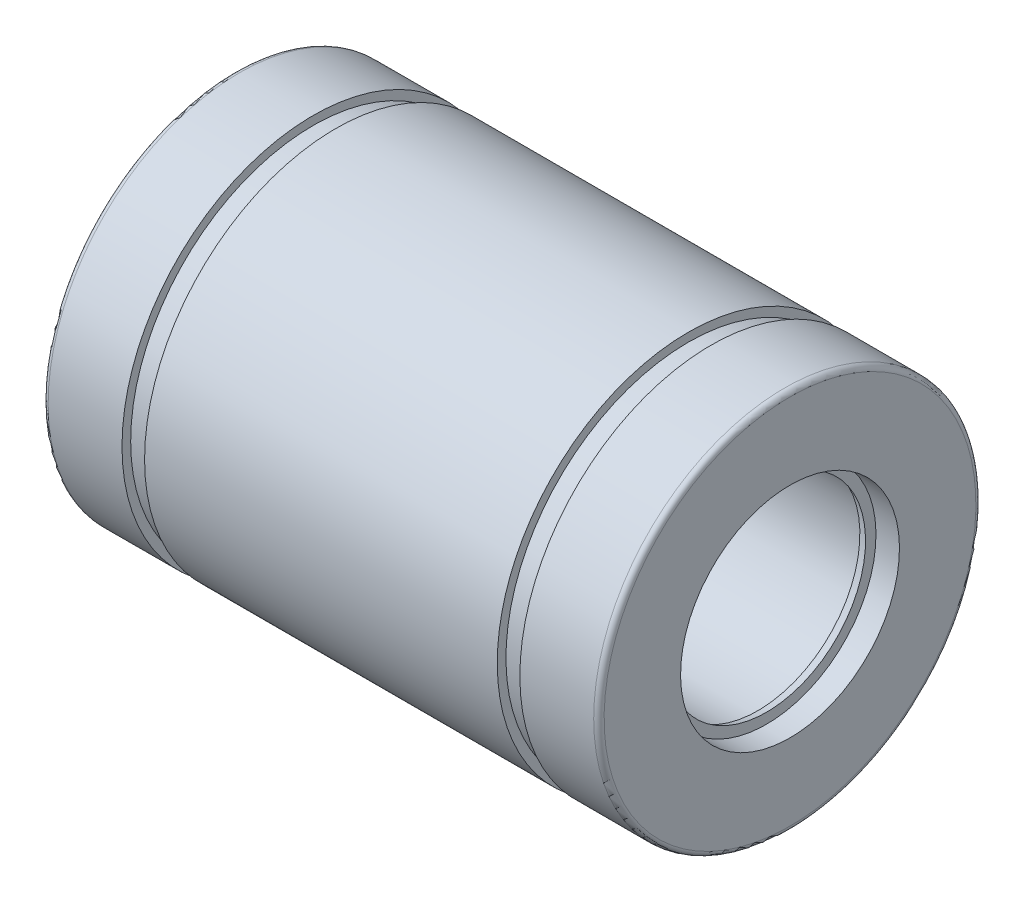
ISO-10303-21;
HEADER;
FILE_DESCRIPTION(('STEP AP214'),'2;1');
FILE_NAME('part.step','',(''),(''),'','','');
FILE_SCHEMA(('AUTOMOTIVE_DESIGN { 1 0 10303 214 1 1 1 1 }'));
ENDSEC;
DATA;
#1=APPLICATION_CONTEXT('core data for automotive mechanical design processes');
#2=APPLICATION_PROTOCOL_DEFINITION('international standard','automotive_design',2000,#1);
#3=PRODUCT_CONTEXT('',#1,'mechanical');
#4=PRODUCT('Part','Part','',(#3));
#5=PRODUCT_RELATED_PRODUCT_CATEGORY('part','',(#4));
#6=PRODUCT_DEFINITION_FORMATION('','',#4);
#7=PRODUCT_DEFINITION_CONTEXT('part definition',#1,'design');
#8=PRODUCT_DEFINITION('design','',#6,#7);
#9=PRODUCT_DEFINITION_SHAPE('','',#8);
#10=(LENGTH_UNIT() NAMED_UNIT(*) SI_UNIT(.MILLI.,.METRE.));
#11=(NAMED_UNIT(*) PLANE_ANGLE_UNIT() SI_UNIT($,.RADIAN.));
#12=(NAMED_UNIT(*) SI_UNIT($,.STERADIAN.) SOLID_ANGLE_UNIT());
#13=UNCERTAINTY_MEASURE_WITH_UNIT(LENGTH_MEASURE(1.E-05),#10,'distance_accuracy_value','');
#14=(GEOMETRIC_REPRESENTATION_CONTEXT(3) GLOBAL_UNCERTAINTY_ASSIGNED_CONTEXT((#13)) GLOBAL_UNIT_ASSIGNED_CONTEXT((#10,
#11,#12)) REPRESENTATION_CONTEXT('',''));
#15=CARTESIAN_POINT('',(0.,0.,0.));
#16=DIRECTION('',(0.,0.,1.));
#17=DIRECTION('',(1.,0.,0.));
#18=AXIS2_PLACEMENT_3D('',#15,#16,#17);
#19=CARTESIAN_POINT('',(0.,0.,-5.5));
#20=DIRECTION('',(-1.,0.,0.));
#21=DIRECTION('',(0.,0.,1.));
#22=AXIS2_PLACEMENT_3D('',#19,#20,#21);
#23=PLANE('',#22);
#24=CARTESIAN_POINT('',(0.,0.,0.));
#25=DIRECTION('',(1.,0.,0.));
#26=DIRECTION('',(0.,0.,-1.));
#27=AXIS2_PLACEMENT_3D('',#24,#25,#26);
#28=CIRCLE('',#27,6.3);
#29=CARTESIAN_POINT('',(0.,0.,6.3));
#30=VERTEX_POINT('',#29);
#31=EDGE_CURVE('E247',#30,#30,#28,.T.);
#32=ORIENTED_EDGE('',*,*,#31,.T.);
#33=EDGE_LOOP('',(#32));
#34=FACE_BOUND('',#33,.T.);
#35=CARTESIAN_POINT('',(0.,0.,0.));
#36=DIRECTION('',(-1.,0.,0.));
#37=DIRECTION('',(0.,0.,1.));
#38=AXIS2_PLACEMENT_3D('',#35,#36,#37);
#39=CIRCLE('',#38,10.7);
#40=CARTESIAN_POINT('',(0.,0.,10.7));
#41=VERTEX_POINT('',#40);
#42=CARTESIAN_POINT('',(0.,10.7,0.));
#43=VERTEX_POINT('',#42);
#44=EDGE_CURVE('E251',#41,#43,#39,.T.);
#45=ORIENTED_EDGE('',*,*,#44,.T.);
#46=CARTESIAN_POINT('',(0.,0.,0.));
#47=DIRECTION('',(-1.,0.,0.));
#48=DIRECTION('',(0.,0.,1.));
#49=AXIS2_PLACEMENT_3D('',#46,#47,#48);
#50=CIRCLE('',#49,10.7);
#51=EDGE_CURVE('E254',#43,#41,#50,.T.);
#52=ORIENTED_EDGE('',*,*,#51,.T.);
#53=EDGE_LOOP('',(#45,#52));
#54=FACE_BOUND('',#53,.T.);
#55=ADVANCED_FACE('F16',(#34,#54),#23,.T.);
#56=CARTESIAN_POINT('',(5.85,0.,-10.75));
#57=DIRECTION('',(1.,0.,0.));
#58=DIRECTION('',(0.,1.,0.));
#59=AXIS2_PLACEMENT_3D('',#56,#57,#58);
#60=PLANE('',#59);
#61=CARTESIAN_POINT('',(5.85,0.,0.));
#62=DIRECTION('',(1.,0.,0.));
#63=DIRECTION('',(0.,0.,-1.));
#64=AXIS2_PLACEMENT_3D('',#61,#62,#63);
#65=CIRCLE('',#64,10.5);
#66=CARTESIAN_POINT('',(5.85,0.,10.5));
#67=VERTEX_POINT('',#66);
#68=EDGE_CURVE('E332',#67,#67,#65,.T.);
#69=ORIENTED_EDGE('',*,*,#68,.T.);
#70=EDGE_LOOP('',(#69));
#71=FACE_BOUND('',#70,.T.);
#72=CARTESIAN_POINT('',(5.85,0.,0.));
#73=DIRECTION('',(1.,0.,0.));
#74=DIRECTION('',(0.,0.,-1.));
#75=AXIS2_PLACEMENT_3D('',#72,#73,#74);
#76=CIRCLE('',#75,11.);
#77=CARTESIAN_POINT('',(5.85,0.,11.));
#78=VERTEX_POINT('',#77);
#79=EDGE_CURVE('E306',#78,#78,#76,.T.);
#80=ORIENTED_EDGE('',*,*,#79,.F.);
#81=EDGE_LOOP('',(#80));
#82=FACE_BOUND('',#81,.T.);
#83=ADVANCED_FACE('F238',(#71,#82),#60,.F.);
#84=CARTESIAN_POINT('',(4.55,0.,-10.75));
#85=DIRECTION('',(-1.,0.,0.));
#86=DIRECTION('',(0.,0.,1.));
#87=AXIS2_PLACEMENT_3D('',#84,#85,#86);
#88=PLANE('',#87);
#89=CARTESIAN_POINT('',(4.55,0.,0.));
#90=DIRECTION('',(1.,0.,0.));
#91=DIRECTION('',(0.,0.,-1.));
#92=AXIS2_PLACEMENT_3D('',#89,#90,#91);
#93=CIRCLE('',#92,10.5);
#94=CARTESIAN_POINT('',(4.55,0.,10.5));
#95=VERTEX_POINT('',#94);
#96=EDGE_CURVE('E323',#95,#95,#93,.T.);
#97=ORIENTED_EDGE('',*,*,#96,.F.);
#98=EDGE_LOOP('',(#97));
#99=FACE_BOUND('',#98,.T.);
#100=CARTESIAN_POINT('',(4.55,0.,0.));
#101=DIRECTION('',(-1.,0.,0.));
#102=DIRECTION('',(0.,0.,-1.));
#103=AXIS2_PLACEMENT_3D('',#100,#101,#102);
#104=CIRCLE('',#103,11.);
#105=CARTESIAN_POINT('',(4.55,0.,11.));
#106=VERTEX_POINT('',#105);
#107=EDGE_CURVE('E268',#106,#106,#104,.T.);
#108=ORIENTED_EDGE('',*,*,#107,.F.);
#109=EDGE_LOOP('',(#108));
#110=FACE_BOUND('',#109,.T.);
#111=ADVANCED_FACE('F243',(#99,#110),#88,.F.);
#112=CARTESIAN_POINT('',(1.352,0.,-6.6));
#113=DIRECTION('',(-1.,0.,0.));
#114=DIRECTION('',(0.,0.,1.));
#115=AXIS2_PLACEMENT_3D('',#112,#113,#114);
#116=PLANE('',#115);
#117=CARTESIAN_POINT('',(1.352,0.,0.));
#118=DIRECTION('',(1.,0.,0.));
#119=DIRECTION('',(0.,0.,-1.));
#120=AXIS2_PLACEMENT_3D('',#117,#118,#119);
#121=CIRCLE('',#120,6.3);
#122=CARTESIAN_POINT('',(1.352,0.,6.3));
#123=VERTEX_POINT('',#122);
#124=EDGE_CURVE('E302',#123,#123,#121,.T.);
#125=ORIENTED_EDGE('',*,*,#124,.F.);
#126=EDGE_LOOP('',(#125));
#127=FACE_BOUND('',#126,.T.);
#128=CARTESIAN_POINT('',(1.352,0.,0.));
#129=DIRECTION('',(1.,0.,0.));
#130=DIRECTION('',(0.,0.,-1.));
#131=AXIS2_PLACEMENT_3D('',#128,#129,#130);
#132=CIRCLE('',#131,7.2);
#133=CARTESIAN_POINT('',(1.352,0.,7.2));
#134=VERTEX_POINT('',#133);
#135=EDGE_CURVE('E352',#134,#134,#132,.T.);
#136=ORIENTED_EDGE('',*,*,#135,.T.);
#137=EDGE_LOOP('',(#136));
#138=FACE_BOUND('',#137,.T.);
#139=ADVANCED_FACE('F462',(#127,#138),#116,.F.);
#140=CARTESIAN_POINT('',(1.859,0.,-6.6));
#141=DIRECTION('',(1.,0.,0.));
#142=DIRECTION('',(0.,0.,-1.));
#143=AXIS2_PLACEMENT_3D('',#140,#141,#142);
#144=PLANE('',#143);
#145=CARTESIAN_POINT('',(1.859,0.,0.));
#146=DIRECTION('',(-1.,0.,0.));
#147=DIRECTION('',(0.,0.,-1.));
#148=AXIS2_PLACEMENT_3D('',#145,#146,#147);
#149=CIRCLE('',#148,6.);
#150=CARTESIAN_POINT('',(1.859,0.,6.));
#151=VERTEX_POINT('',#150);
#152=EDGE_CURVE('E280',#151,#151,#149,.T.);
#153=ORIENTED_EDGE('',*,*,#152,.F.);
#154=EDGE_LOOP('',(#153));
#155=FACE_BOUND('',#154,.T.);
#156=CARTESIAN_POINT('',(1.859,0.,0.));
#157=DIRECTION('',(1.,0.,0.));
#158=DIRECTION('',(0.,0.,-1.));
#159=AXIS2_PLACEMENT_3D('',#156,#157,#158);
#160=CIRCLE('',#159,7.2);
#161=CARTESIAN_POINT('',(1.859,0.,7.2));
#162=VERTEX_POINT('',#161);
#163=EDGE_CURVE('E177',#162,#162,#160,.T.);
#164=ORIENTED_EDGE('',*,*,#163,.F.);
#165=EDGE_LOOP('',(#164));
#166=FACE_BOUND('',#165,.T.);
#167=ADVANCED_FACE('F456',(#155,#166),#144,.F.);
#168=CARTESIAN_POINT('',(32.,2.75,4.76313972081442));
#169=DIRECTION('',(1.,0.,0.));
#170=DIRECTION('',(0.,-1.,0.));
#171=AXIS2_PLACEMENT_3D('',#168,#169,#170);
#172=PLANE('',#171);
#173=CARTESIAN_POINT('',(32.,0.,0.));
#174=DIRECTION('',(-1.,0.,0.));
#175=DIRECTION('',(0.,0.5,0.866025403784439));
#176=AXIS2_PLACEMENT_3D('',#173,#174,#175);
#177=CIRCLE('',#176,6.3);
#178=CARTESIAN_POINT('',(32.,-3.15,-5.45596004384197));
#179=VERTEX_POINT('',#178);
#180=EDGE_CURVE('E162',#179,#179,#177,.T.);
#181=ORIENTED_EDGE('',*,*,#180,.T.);
#182=EDGE_LOOP('',(#181));
#183=FACE_BOUND('',#182,.T.);
#184=CARTESIAN_POINT('',(32.,0.,0.));
#185=DIRECTION('',(1.,0.,0.));
#186=DIRECTION('',(0.,0.,-1.));
#187=AXIS2_PLACEMENT_3D('',#184,#185,#186);
#188=CIRCLE('',#187,10.7);
#189=CARTESIAN_POINT('',(32.,-5.35,-9.26647182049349));
#190=VERTEX_POINT('',#189);
#191=CARTESIAN_POINT('',(32.,9.26647182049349,-5.35));
#192=VERTEX_POINT('',#191);
#193=EDGE_CURVE('E364',#190,#192,#188,.T.);
#194=ORIENTED_EDGE('',*,*,#193,.T.);
#195=CARTESIAN_POINT('',(32.,0.,0.));
#196=DIRECTION('',(1.,0.,0.));
#197=DIRECTION('',(0.,0.,-1.));
#198=AXIS2_PLACEMENT_3D('',#195,#196,#197);
#199=CIRCLE('',#198,10.7);
#200=EDGE_CURVE('E360',#192,#190,#199,.T.);
#201=ORIENTED_EDGE('',*,*,#200,.T.);
#202=EDGE_LOOP('',(#194,#201));
#203=FACE_BOUND('',#202,.T.);
#204=ADVANCED_FACE('F451',(#183,#203),#172,.T.);
#205=CARTESIAN_POINT('',(26.15,5.375,9.30977309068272));
#206=DIRECTION('',(-1.,0.,0.));
#207=DIRECTION('',(0.,0.,1.));
#208=AXIS2_PLACEMENT_3D('',#205,#206,#207);
#209=PLANE('',#208);
#210=CARTESIAN_POINT('',(26.15,0.,0.));
#211=DIRECTION('',(-1.,0.,0.));
#212=DIRECTION('',(0.,0.5,0.866025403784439));
#213=AXIS2_PLACEMENT_3D('',#210,#211,#212);
#214=CIRCLE('',#213,10.5);
#215=CARTESIAN_POINT('',(26.15,-5.25,-9.09326673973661));
#216=VERTEX_POINT('',#215);
#217=EDGE_CURVE('E156',#216,#216,#214,.T.);
#218=ORIENTED_EDGE('',*,*,#217,.T.);
#219=EDGE_LOOP('',(#218));
#220=FACE_BOUND('',#219,.T.);
#221=CARTESIAN_POINT('',(26.15,0.,0.));
#222=DIRECTION('',(-1.,0.,0.));
#223=DIRECTION('',(0.,0.5,0.866025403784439));
#224=AXIS2_PLACEMENT_3D('',#221,#222,#223);
#225=CIRCLE('',#224,11.);
#226=CARTESIAN_POINT('',(26.15,5.5,9.52627944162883));
#227=VERTEX_POINT('',#226);
#228=CARTESIAN_POINT('',(26.15,0.,11.));
#229=VERTEX_POINT('',#228);
#230=EDGE_CURVE('E317',#227,#229,#225,.T.);
#231=ORIENTED_EDGE('',*,*,#230,.F.);
#232=CARTESIAN_POINT('',(26.15,0.,0.));
#233=DIRECTION('',(-1.,0.,0.));
#234=DIRECTION('',(0.,0.5,0.866025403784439));
#235=AXIS2_PLACEMENT_3D('',#232,#233,#234);
#236=CIRCLE('',#235,11.);
#237=EDGE_CURVE('E311',#229,#227,#236,.T.);
#238=ORIENTED_EDGE('',*,*,#237,.F.);
#239=EDGE_LOOP('',(#231,#238));
#240=FACE_BOUND('',#239,.T.);
#241=ADVANCED_FACE('F232',(#220,#240),#209,.F.);
#242=CARTESIAN_POINT('',(27.45,5.375,9.30977309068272));
#243=DIRECTION('',(1.,0.,0.));
#244=DIRECTION('',(0.,-1.,0.));
#245=AXIS2_PLACEMENT_3D('',#242,#243,#244);
#246=PLANE('',#245);
#247=CARTESIAN_POINT('',(27.45,0.,0.));
#248=DIRECTION('',(-1.,0.,0.));
#249=DIRECTION('',(0.,0.5,0.866025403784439));
#250=AXIS2_PLACEMENT_3D('',#247,#248,#249);
#251=CIRCLE('',#250,10.5);
#252=CARTESIAN_POINT('',(27.45,-5.25,-9.09326673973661));
#253=VERTEX_POINT('',#252);
#254=EDGE_CURVE('E383',#253,#253,#251,.T.);
#255=ORIENTED_EDGE('',*,*,#254,.F.);
#256=EDGE_LOOP('',(#255));
#257=FACE_BOUND('',#256,.T.);
#258=CARTESIAN_POINT('',(27.45,0.,0.));
#259=DIRECTION('',(1.,0.,0.));
#260=DIRECTION('',(0.,0.5,0.866025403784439));
#261=AXIS2_PLACEMENT_3D('',#258,#259,#260);
#262=CIRCLE('',#261,11.);
#263=CARTESIAN_POINT('',(27.45,-5.5,-9.52627944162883));
#264=VERTEX_POINT('',#263);
#265=EDGE_CURVE('E372',#264,#264,#262,.T.);
#266=ORIENTED_EDGE('',*,*,#265,.F.);
#267=EDGE_LOOP('',(#266));
#268=FACE_BOUND('',#267,.T.);
#269=ADVANCED_FACE('F221',(#257,#268),#246,.F.);
#270=CARTESIAN_POINT('',(30.648,3.3,5.7157676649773));
#271=DIRECTION('',(1.,0.,0.));
#272=DIRECTION('',(0.,-1.,0.));
#273=AXIS2_PLACEMENT_3D('',#270,#271,#272);
#274=PLANE('',#273);
#275=CARTESIAN_POINT('',(30.648,0.,0.));
#276=DIRECTION('',(-1.,0.,0.));
#277=DIRECTION('',(0.,0.5,0.866025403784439));
#278=AXIS2_PLACEMENT_3D('',#275,#276,#277);
#279=CIRCLE('',#278,6.3);
#280=CARTESIAN_POINT('',(30.648,-3.15,-5.45596004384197));
#281=VERTEX_POINT('',#280);
#282=EDGE_CURVE('E163',#281,#281,#279,.T.);
#283=ORIENTED_EDGE('',*,*,#282,.F.);
#284=EDGE_LOOP('',(#283));
#285=FACE_BOUND('',#284,.T.);
#286=CARTESIAN_POINT('',(30.648,0.,0.));
#287=DIRECTION('',(-1.,0.,0.));
#288=DIRECTION('',(0.,0.5,0.866025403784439));
#289=AXIS2_PLACEMENT_3D('',#286,#287,#288);
#290=CIRCLE('',#289,7.2);
#291=CARTESIAN_POINT('',(30.648,-3.6,-6.23538290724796));
#292=VERTEX_POINT('',#291);
#293=EDGE_CURVE('E174',#292,#292,#290,.T.);
#294=ORIENTED_EDGE('',*,*,#293,.T.);
#295=EDGE_LOOP('',(#294));
#296=FACE_BOUND('',#295,.T.);
#297=ADVANCED_FACE('F218',(#285,#296),#274,.F.);
#298=CARTESIAN_POINT('',(30.141,3.3,5.7157676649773));
#299=DIRECTION('',(-1.,0.,0.));
#300=DIRECTION('',(0.,0.,1.));
#301=AXIS2_PLACEMENT_3D('',#298,#299,#300);
#302=PLANE('',#301);
#303=CARTESIAN_POINT('',(30.141,0.,0.));
#304=DIRECTION('',(1.,0.,0.));
#305=DIRECTION('',(0.,0.5,0.866025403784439));
#306=AXIS2_PLACEMENT_3D('',#303,#304,#305);
#307=CIRCLE('',#306,6.);
#308=CARTESIAN_POINT('',(30.141,3.,5.19615242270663));
#309=VERTEX_POINT('',#308);
#310=CARTESIAN_POINT('',(30.141,0.,6.));
#311=VERTEX_POINT('',#310);
#312=EDGE_CURVE('E281',#309,#311,#307,.T.);
#313=ORIENTED_EDGE('',*,*,#312,.F.);
#314=CARTESIAN_POINT('',(30.141,0.,0.));
#315=DIRECTION('',(1.,0.,0.));
#316=DIRECTION('',(0.,0.5,0.866025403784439));
#317=AXIS2_PLACEMENT_3D('',#314,#315,#316);
#318=CIRCLE('',#317,6.);
#319=EDGE_CURVE('E303',#311,#309,#318,.T.);
#320=ORIENTED_EDGE('',*,*,#319,.F.);
#321=EDGE_LOOP('',(#313,#320));
#322=FACE_BOUND('',#321,.T.);
#323=CARTESIAN_POINT('',(30.141,0.,0.));
#324=DIRECTION('',(-1.,0.,0.));
#325=DIRECTION('',(0.,0.5,0.866025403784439));
#326=AXIS2_PLACEMENT_3D('',#323,#324,#325);
#327=CIRCLE('',#326,7.2);
#328=CARTESIAN_POINT('',(30.141,-3.6,-6.23538290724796));
#329=VERTEX_POINT('',#328);
#330=EDGE_CURVE('E152',#329,#329,#327,.T.);
#331=ORIENTED_EDGE('',*,*,#330,.F.);
#332=EDGE_LOOP('',(#331));
#333=FACE_BOUND('',#332,.T.);
#334=ADVANCED_FACE('F220',(#322,#333),#302,.F.);
#335=CARTESIAN_POINT('',(1.858,0.,-3.6036));
#336=DIRECTION('',(1.,0.,0.));
#337=DIRECTION('',(0.,1.,0.));
#338=AXIS2_PLACEMENT_3D('',#335,#336,#337);
#339=PLANE('',#338);
#340=CARTESIAN_POINT('',(1.858,0.,0.));
#341=DIRECTION('',(-1.,0.,0.));
#342=DIRECTION('',(0.,0.,-1.));
#343=AXIS2_PLACEMENT_3D('',#340,#341,#342);
#344=CIRCLE('',#343,5.88);
#345=CARTESIAN_POINT('',(1.858,0.,5.88));
#346=VERTEX_POINT('',#345);
#347=EDGE_CURVE('E196',#346,#346,#344,.T.);
#348=ORIENTED_EDGE('',*,*,#347,.T.);
#349=EDGE_LOOP('',(#348));
#350=FACE_BOUND('',#349,.T.);
#351=CARTESIAN_POINT('',(1.858,0.,0.));
#352=DIRECTION('',(-1.,0.,0.));
#353=DIRECTION('',(0.,0.,-1.));
#354=AXIS2_PLACEMENT_3D('',#351,#352,#353);
#355=CIRCLE('',#354,7.2);
#356=CARTESIAN_POINT('',(1.858,0.,7.2));
#357=VERTEX_POINT('',#356);
#358=EDGE_CURVE('E185',#357,#357,#355,.T.);
#359=ORIENTED_EDGE('',*,*,#358,.F.);
#360=EDGE_LOOP('',(#359));
#361=FACE_BOUND('',#360,.T.);
#362=ADVANCED_FACE('F229',(#350,#361),#339,.T.);
#363=CARTESIAN_POINT('',(1.353,0.,-3.6036));
#364=DIRECTION('',(-1.,0.,0.));
#365=DIRECTION('',(0.,0.,1.));
#366=AXIS2_PLACEMENT_3D('',#363,#364,#365);
#367=PLANE('',#366);
#368=CARTESIAN_POINT('',(1.353,0.,0.));
#369=DIRECTION('',(1.,0.,0.));
#370=DIRECTION('',(0.,0.,-1.));
#371=AXIS2_PLACEMENT_3D('',#368,#369,#370);
#372=CIRCLE('',#371,5.7);
#373=CARTESIAN_POINT('',(1.353,0.,5.7));
#374=VERTEX_POINT('',#373);
#375=EDGE_CURVE('E188',#374,#374,#372,.T.);
#376=ORIENTED_EDGE('',*,*,#375,.T.);
#377=EDGE_LOOP('',(#376));
#378=FACE_BOUND('',#377,.T.);
#379=CARTESIAN_POINT('',(1.353,0.,0.));
#380=DIRECTION('',(1.,0.,0.));
#381=DIRECTION('',(0.,0.,-1.));
#382=AXIS2_PLACEMENT_3D('',#379,#380,#381);
#383=CIRCLE('',#382,7.2);
#384=CARTESIAN_POINT('',(1.353,0.,7.2));
#385=VERTEX_POINT('',#384);
#386=EDGE_CURVE('E336',#385,#385,#383,.T.);
#387=ORIENTED_EDGE('',*,*,#386,.F.);
#388=EDGE_LOOP('',(#387));
#389=FACE_BOUND('',#388,.T.);
#390=ADVANCED_FACE('F532',(#378,#389),#367,.T.);
#391=CARTESIAN_POINT('',(30.142,1.8018,3.1208091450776));
#392=DIRECTION('',(-1.,0.,0.));
#393=DIRECTION('',(0.,0.,1.));
#394=AXIS2_PLACEMENT_3D('',#391,#392,#393);
#395=PLANE('',#394);
#396=CARTESIAN_POINT('',(30.142,0.,0.));
#397=DIRECTION('',(1.,0.,0.));
#398=DIRECTION('',(0.,0.5,0.866025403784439));
#399=AXIS2_PLACEMENT_3D('',#396,#397,#398);
#400=CIRCLE('',#399,5.88);
#401=CARTESIAN_POINT('',(30.142,-2.94,-5.0922293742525));
#402=VERTEX_POINT('',#401);
#403=EDGE_CURVE('E10',#402,#402,#400,.T.);
#404=ORIENTED_EDGE('',*,*,#403,.T.);
#405=EDGE_LOOP('',(#404));
#406=FACE_BOUND('',#405,.T.);
#407=CARTESIAN_POINT('',(30.142,0.,0.));
#408=DIRECTION('',(1.,0.,0.));
#409=DIRECTION('',(0.,0.5,0.866025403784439));
#410=AXIS2_PLACEMENT_3D('',#407,#408,#409);
#411=CIRCLE('',#410,7.2);
#412=CARTESIAN_POINT('',(30.142,-3.6,-6.23538290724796));
#413=VERTEX_POINT('',#412);
#414=EDGE_CURVE('E137',#413,#413,#411,.T.);
#415=ORIENTED_EDGE('',*,*,#414,.F.);
#416=EDGE_LOOP('',(#415));
#417=FACE_BOUND('',#416,.T.);
#418=ADVANCED_FACE('F211',(#406,#417),#395,.T.);
#419=CARTESIAN_POINT('',(30.647,1.8018,3.1208091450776));
#420=DIRECTION('',(1.,0.,0.));
#421=DIRECTION('',(0.,-1.,0.));
#422=AXIS2_PLACEMENT_3D('',#419,#420,#421);
#423=PLANE('',#422);
#424=CARTESIAN_POINT('',(30.647,0.,0.));
#425=DIRECTION('',(-1.,0.,0.));
#426=DIRECTION('',(0.,0.5,0.866025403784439));
#427=AXIS2_PLACEMENT_3D('',#424,#425,#426);
#428=CIRCLE('',#427,5.7);
#429=CARTESIAN_POINT('',(30.647,-2.85,-4.9363448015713));
#430=VERTEX_POINT('',#429);
#431=EDGE_CURVE('E143',#430,#430,#428,.T.);
#432=ORIENTED_EDGE('',*,*,#431,.T.);
#433=EDGE_LOOP('',(#432));
#434=FACE_BOUND('',#433,.T.);
#435=CARTESIAN_POINT('',(30.647,0.,0.));
#436=DIRECTION('',(-1.,0.,0.));
#437=DIRECTION('',(0.,0.5,0.866025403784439));
#438=AXIS2_PLACEMENT_3D('',#435,#436,#437);
#439=CIRCLE('',#438,7.2);
#440=CARTESIAN_POINT('',(30.647,-3.6,-6.23538290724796));
#441=VERTEX_POINT('',#440);
#442=EDGE_CURVE('E166',#441,#441,#439,.T.);
#443=ORIENTED_EDGE('',*,*,#442,.F.);
#444=EDGE_LOOP('',(#443));
#445=FACE_BOUND('',#444,.T.);
#446=ADVANCED_FACE('F208',(#434,#445),#423,.T.);
#447=CARTESIAN_POINT('',(30.3945,0.,0.));
#448=DIRECTION('',(-1.,0.,0.));
#449=DIRECTION('',(0.,0.5,0.866025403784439));
#450=AXIS2_PLACEMENT_3D('',#447,#448,#449);
#451=CONICAL_SURFACE('',#450,5.79,0.34239658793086);
#452=ORIENTED_EDGE('',*,*,#431,.F.);
#453=DIRECTION('',(-0.941952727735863,-0.167872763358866,-0.290764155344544));
#454=VECTOR('',#453,1.);
#455=CARTESIAN_POINT('',(30.3945,-2.895,-5.0142870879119));
#456=LINE('',#455,#454);
#457=EDGE_CURVE('E25',#430,#402,#456,.T.);
#458=ORIENTED_EDGE('',*,*,#457,.T.);
#459=ORIENTED_EDGE('',*,*,#403,.F.);
#460=ORIENTED_EDGE('',*,*,#457,.F.);
#461=EDGE_LOOP('',(#452,#458,#459,#460));
#462=FACE_BOUND('',#461,.T.);
#463=ADVANCED_FACE('F206',(#462),#451,.F.);
#464=CARTESIAN_POINT('',(30.3945,0.,0.));
#465=DIRECTION('',(1.,0.,0.));
#466=DIRECTION('',(0.,0.5,0.866025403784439));
#467=AXIS2_PLACEMENT_3D('',#464,#465,#466);
#468=CYLINDRICAL_SURFACE('',#467,7.2);
#469=ORIENTED_EDGE('',*,*,#330,.T.);
#470=DIRECTION('',(1.,0.,0.));
#471=VECTOR('',#470,1.);
#472=CARTESIAN_POINT('',(30.3945,-3.6,-6.23538290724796));
#473=LINE('',#472,#471);
#474=EDGE_CURVE('E140',#329,#413,#473,.T.);
#475=ORIENTED_EDGE('',*,*,#474,.T.);
#476=ORIENTED_EDGE('',*,*,#414,.T.);
#477=ORIENTED_EDGE('',*,*,#474,.F.);
#478=EDGE_LOOP('',(#469,#475,#476,#477));
#479=FACE_BOUND('',#478,.T.);
#480=ADVANCED_FACE('F139',(#479),#468,.F.);
#481=CARTESIAN_POINT('',(1.6055,0.,0.));
#482=DIRECTION('',(1.,0.,0.));
#483=DIRECTION('',(0.,0.,-1.));
#484=AXIS2_PLACEMENT_3D('',#481,#482,#483);
#485=CONICAL_SURFACE('',#484,5.79,0.34239658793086);
#486=ORIENTED_EDGE('',*,*,#375,.F.);
#487=DIRECTION('',(0.941952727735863,0.,0.335745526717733));
#488=VECTOR('',#487,1.);
#489=CARTESIAN_POINT('',(1.6055,0.,5.79));
#490=LINE('',#489,#488);
#491=EDGE_CURVE('E192',#374,#346,#490,.T.);
#492=ORIENTED_EDGE('',*,*,#491,.T.);
#493=ORIENTED_EDGE('',*,*,#347,.F.);
#494=ORIENTED_EDGE('',*,*,#491,.F.);
#495=EDGE_LOOP('',(#486,#492,#493,#494));
#496=FACE_BOUND('',#495,.T.);
#497=ADVANCED_FACE('F497',(#496),#485,.F.);
#498=CARTESIAN_POINT('',(1.6055,0.,0.));
#499=DIRECTION('',(-1.,0.,0.));
#500=DIRECTION('',(0.,0.,-1.));
#501=AXIS2_PLACEMENT_3D('',#498,#499,#500);
#502=CYLINDRICAL_SURFACE('',#501,7.2);
#503=ORIENTED_EDGE('',*,*,#163,.T.);
#504=DIRECTION('',(-1.,0.,0.));
#505=VECTOR('',#504,1.);
#506=CARTESIAN_POINT('',(1.6055,0.,7.2));
#507=LINE('',#506,#505);
#508=EDGE_CURVE('E181',#162,#357,#507,.T.);
#509=ORIENTED_EDGE('',*,*,#508,.T.);
#510=ORIENTED_EDGE('',*,*,#358,.T.);
#511=ORIENTED_EDGE('',*,*,#508,.F.);
#512=EDGE_LOOP('',(#503,#509,#510,#511));
#513=FACE_BOUND('',#512,.T.);
#514=ADVANCED_FACE('F502',(#513),#502,.F.);
#515=CARTESIAN_POINT('',(30.3945,0.,0.));
#516=DIRECTION('',(1.,0.,0.));
#517=DIRECTION('',(0.,0.5,0.866025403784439));
#518=AXIS2_PLACEMENT_3D('',#515,#516,#517);
#519=CYLINDRICAL_SURFACE('',#518,7.2);
#520=ORIENTED_EDGE('',*,*,#442,.T.);
#521=DIRECTION('',(1.,0.,0.));
#522=VECTOR('',#521,1.);
#523=CARTESIAN_POINT('',(30.3945,-3.6,-6.23538290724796));
#524=LINE('',#523,#522);
#525=EDGE_CURVE('E170',#441,#292,#524,.T.);
#526=ORIENTED_EDGE('',*,*,#525,.T.);
#527=ORIENTED_EDGE('',*,*,#293,.F.);
#528=ORIENTED_EDGE('',*,*,#525,.F.);
#529=EDGE_LOOP('',(#520,#526,#527,#528));
#530=FACE_BOUND('',#529,.T.);
#531=ADVANCED_FACE('F215',(#530),#519,.F.);
#532=CARTESIAN_POINT('',(31.324,0.,0.));
#533=DIRECTION('',(1.,0.,0.));
#534=DIRECTION('',(0.,0.5,0.866025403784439));
#535=AXIS2_PLACEMENT_3D('',#532,#533,#534);
#536=CYLINDRICAL_SURFACE('',#535,6.3);
#537=ORIENTED_EDGE('',*,*,#282,.T.);
#538=DIRECTION('',(1.,0.,0.));
#539=VECTOR('',#538,1.);
#540=CARTESIAN_POINT('',(31.324,-3.15,-5.45596004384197));
#541=LINE('',#540,#539);
#542=EDGE_CURVE('E158',#281,#179,#541,.T.);
#543=ORIENTED_EDGE('',*,*,#542,.T.);
#544=ORIENTED_EDGE('',*,*,#180,.F.);
#545=ORIENTED_EDGE('',*,*,#542,.F.);
#546=EDGE_LOOP('',(#537,#543,#544,#545));
#547=FACE_BOUND('',#546,.T.);
#548=ADVANCED_FACE('F501',(#547),#536,.F.);
#549=CARTESIAN_POINT('',(27.125,0.,0.));
#550=DIRECTION('',(1.,0.,0.));
#551=DIRECTION('',(0.,0.5,0.866025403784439));
#552=AXIS2_PLACEMENT_3D('',#549,#550,#551);
#553=CYLINDRICAL_SURFACE('',#552,10.5);
#554=ORIENTED_EDGE('',*,*,#254,.T.);
#555=DIRECTION('',(-1.,0.,0.));
#556=VECTOR('',#555,1.);
#557=CARTESIAN_POINT('',(27.125,-5.25,-9.09326673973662));
#558=LINE('',#557,#556);
#559=EDGE_CURVE('E386',#253,#216,#558,.T.);
#560=ORIENTED_EDGE('',*,*,#559,.T.);
#561=ORIENTED_EDGE('',*,*,#217,.F.);
#562=ORIENTED_EDGE('',*,*,#559,.F.);
#563=EDGE_LOOP('',(#554,#560,#561,#562));
#564=FACE_BOUND('',#563,.T.);
#565=ADVANCED_FACE('F398',(#564),#553,.T.);
#566=CARTESIAN_POINT('',(31.7,0.,0.));
#567=DIRECTION('',(1.,0.,0.));
#568=DIRECTION('',(0.,-0.866025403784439,0.5));
#569=AXIS2_PLACEMENT_3D('',#566,#567,#568);
#570=TOROIDAL_SURFACE('',#569,10.7,0.3);
#571=ORIENTED_EDGE('',*,*,#193,.F.);
#572=ORIENTED_EDGE('',*,*,#200,.F.);
#573=CARTESIAN_POINT('',(31.7,9.26647182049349,-5.35));
#574=DIRECTION('',(0.,0.5,0.866025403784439));
#575=DIRECTION('',(0.,0.866025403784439,-0.5));
#576=AXIS2_PLACEMENT_3D('',#573,#574,#575);
#577=CIRCLE('',#576,0.3);
#578=CARTESIAN_POINT('',(31.7,9.52627944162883,-5.5));
#579=VERTEX_POINT('',#578);
#580=EDGE_CURVE('E363',#192,#579,#577,.T.);
#581=ORIENTED_EDGE('',*,*,#580,.T.);
#582=CARTESIAN_POINT('',(31.7,0.,0.));
#583=DIRECTION('',(-1.,0.,0.));
#584=DIRECTION('',(0.,0.5,0.866025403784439));
#585=AXIS2_PLACEMENT_3D('',#582,#583,#584);
#586=CIRCLE('',#585,11.);
#587=CARTESIAN_POINT('',(31.7,-9.52627944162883,5.5));
#588=VERTEX_POINT('',#587);
#589=EDGE_CURVE('E355',#588,#579,#586,.T.);
#590=ORIENTED_EDGE('',*,*,#589,.F.);
#591=CARTESIAN_POINT('',(31.7,0.,0.));
#592=DIRECTION('',(-1.,0.,0.));
#593=DIRECTION('',(0.,0.5,0.866025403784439));
#594=AXIS2_PLACEMENT_3D('',#591,#592,#593);
#595=CIRCLE('',#594,11.);
#596=CARTESIAN_POINT('',(31.7,-5.5,-9.52627944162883));
#597=VERTEX_POINT('',#596);
#598=EDGE_CURVE('E375',#597,#588,#595,.T.);
#599=ORIENTED_EDGE('',*,*,#598,.F.);
#600=CARTESIAN_POINT('',(31.7,0.,0.));
#601=DIRECTION('',(-1.,0.,0.));
#602=DIRECTION('',(0.,0.5,0.866025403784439));
#603=AXIS2_PLACEMENT_3D('',#600,#601,#602);
#604=CIRCLE('',#603,11.);
#605=EDGE_CURVE('E359',#579,#597,#604,.T.);
#606=ORIENTED_EDGE('',*,*,#605,.F.);
#607=ORIENTED_EDGE('',*,*,#580,.F.);
#608=EDGE_LOOP('',(#571,#572,#581,#590,#599,#606,#607));
#609=FACE_BOUND('',#608,.T.);
#610=ADVANCED_FACE('F514',(#609),#570,.T.);
#611=CARTESIAN_POINT('',(27.775,0.,0.));
#612=DIRECTION('',(1.,0.,0.));
#613=DIRECTION('',(0.,0.5,0.866025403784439));
#614=AXIS2_PLACEMENT_3D('',#611,#612,#613);
#615=CYLINDRICAL_SURFACE('',#614,11.);
#616=ORIENTED_EDGE('',*,*,#589,.T.);
#617=ORIENTED_EDGE('',*,*,#605,.T.);
#618=DIRECTION('',(-1.,0.,0.));
#619=VECTOR('',#618,1.);
#620=CARTESIAN_POINT('',(27.775,-5.5,-9.52627944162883));
#621=LINE('',#620,#619);
#622=EDGE_CURVE('E368',#597,#264,#621,.T.);
#623=ORIENTED_EDGE('',*,*,#622,.T.);
#624=ORIENTED_EDGE('',*,*,#265,.T.);
#625=ORIENTED_EDGE('',*,*,#622,.F.);
#626=ORIENTED_EDGE('',*,*,#598,.T.);
#627=EDGE_LOOP('',(#616,#617,#623,#624,#625,#626));
#628=FACE_BOUND('',#627,.T.);
#629=ADVANCED_FACE('F404',(#628),#615,.T.);
#630=CARTESIAN_POINT('',(1.6055,0.,0.));
#631=DIRECTION('',(-1.,0.,0.));
#632=DIRECTION('',(0.,0.,-1.));
#633=AXIS2_PLACEMENT_3D('',#630,#631,#632);
#634=CYLINDRICAL_SURFACE('',#633,7.2);
#635=ORIENTED_EDGE('',*,*,#386,.T.);
#636=DIRECTION('',(-1.,0.,0.));
#637=VECTOR('',#636,1.);
#638=CARTESIAN_POINT('',(1.6055,0.,7.2));
#639=LINE('',#638,#637);
#640=EDGE_CURVE('E340',#385,#134,#639,.T.);
#641=ORIENTED_EDGE('',*,*,#640,.T.);
#642=ORIENTED_EDGE('',*,*,#135,.F.);
#643=ORIENTED_EDGE('',*,*,#640,.F.);
#644=EDGE_LOOP('',(#635,#641,#642,#643));
#645=FACE_BOUND('',#644,.T.);
#646=ADVANCED_FACE('F509',(#645),#634,.F.);
#647=CARTESIAN_POINT('',(0.676,0.,0.));
#648=DIRECTION('',(-1.,0.,0.));
#649=DIRECTION('',(0.,0.,-1.));
#650=AXIS2_PLACEMENT_3D('',#647,#648,#649);
#651=CYLINDRICAL_SURFACE('',#650,6.3);
#652=ORIENTED_EDGE('',*,*,#124,.T.);
#653=DIRECTION('',(-1.,0.,0.));
#654=VECTOR('',#653,1.);
#655=CARTESIAN_POINT('',(0.676,0.,6.3));
#656=LINE('',#655,#654);
#657=EDGE_CURVE('E298',#123,#30,#656,.T.);
#658=ORIENTED_EDGE('',*,*,#657,.T.);
#659=ORIENTED_EDGE('',*,*,#31,.F.);
#660=ORIENTED_EDGE('',*,*,#657,.F.);
#661=EDGE_LOOP('',(#652,#658,#659,#660));
#662=FACE_BOUND('',#661,.T.);
#663=ADVANCED_FACE('F494',(#662),#651,.F.);
#664=CARTESIAN_POINT('',(4.875,0.,0.));
#665=DIRECTION('',(-1.,0.,0.));
#666=DIRECTION('',(0.,0.,-1.));
#667=AXIS2_PLACEMENT_3D('',#664,#665,#666);
#668=CYLINDRICAL_SURFACE('',#667,10.5);
#669=ORIENTED_EDGE('',*,*,#96,.T.);
#670=DIRECTION('',(1.,0.,0.));
#671=VECTOR('',#670,1.);
#672=CARTESIAN_POINT('',(4.875,0.,10.5));
#673=LINE('',#672,#671);
#674=EDGE_CURVE('E328',#95,#67,#673,.T.);
#675=ORIENTED_EDGE('',*,*,#674,.T.);
#676=ORIENTED_EDGE('',*,*,#68,.F.);
#677=ORIENTED_EDGE('',*,*,#674,.F.);
#678=EDGE_LOOP('',(#669,#675,#676,#677));
#679=FACE_BOUND('',#678,.T.);
#680=ADVANCED_FACE('F491',(#679),#668,.T.);
#681=CARTESIAN_POINT('',(4.225,0.,0.));
#682=DIRECTION('',(-1.,0.,0.));
#683=DIRECTION('',(0.,0.,-1.));
#684=AXIS2_PLACEMENT_3D('',#681,#682,#683);
#685=CYLINDRICAL_SURFACE('',#684,11.);
#686=ORIENTED_EDGE('',*,*,#79,.T.);
#687=DIRECTION('',(1.,0.,0.));
#688=VECTOR('',#687,1.);
#689=CARTESIAN_POINT('',(4.225,0.,11.));
#690=LINE('',#689,#688);
#691=EDGE_CURVE('E307',#78,#229,#690,.T.);
#692=ORIENTED_EDGE('',*,*,#691,.T.);
#693=ORIENTED_EDGE('',*,*,#237,.T.);
#694=ORIENTED_EDGE('',*,*,#230,.T.);
#695=ORIENTED_EDGE('',*,*,#691,.F.);
#696=EDGE_LOOP('',(#686,#692,#693,#694,#695));
#697=FACE_BOUND('',#696,.T.);
#698=ADVANCED_FACE('F446',(#697),#685,.T.);
#699=CARTESIAN_POINT('',(4.225,0.,0.));
#700=DIRECTION('',(-1.,0.,0.));
#701=DIRECTION('',(0.,0.,-1.));
#702=AXIS2_PLACEMENT_3D('',#699,#700,#701);
#703=CYLINDRICAL_SURFACE('',#702,6.);
#704=ORIENTED_EDGE('',*,*,#312,.T.);
#705=DIRECTION('',(-1.,0.,0.));
#706=VECTOR('',#705,1.);
#707=CARTESIAN_POINT('',(4.225,0.,6.));
#708=LINE('',#707,#706);
#709=EDGE_CURVE('E276',#311,#151,#708,.T.);
#710=ORIENTED_EDGE('',*,*,#709,.T.);
#711=ORIENTED_EDGE('',*,*,#152,.T.);
#712=ORIENTED_EDGE('',*,*,#709,.F.);
#713=ORIENTED_EDGE('',*,*,#319,.T.);
#714=EDGE_LOOP('',(#704,#710,#711,#712,#713));
#715=FACE_BOUND('',#714,.T.);
#716=ADVANCED_FACE('F481',(#715),#703,.F.);
#717=CARTESIAN_POINT('',(0.3,0.,0.));
#718=DIRECTION('',(-1.,0.,0.));
#719=DIRECTION('',(0.,-1.,0.));
#720=AXIS2_PLACEMENT_3D('',#717,#718,#719);
#721=TOROIDAL_SURFACE('',#720,10.7,0.3);
#722=ORIENTED_EDGE('',*,*,#44,.F.);
#723=ORIENTED_EDGE('',*,*,#51,.F.);
#724=CARTESIAN_POINT('',(0.3,10.7,0.));
#725=DIRECTION('',(0.,0.,-1.));
#726=DIRECTION('',(0.,1.,0.));
#727=AXIS2_PLACEMENT_3D('',#724,#725,#726);
#728=CIRCLE('',#727,0.3);
#729=CARTESIAN_POINT('',(0.3,11.,0.));
#730=VERTEX_POINT('',#729);
#731=EDGE_CURVE('E265',#43,#730,#728,.T.);
#732=ORIENTED_EDGE('',*,*,#731,.T.);
#733=CARTESIAN_POINT('',(0.3,0.,0.));
#734=DIRECTION('',(1.,0.,0.));
#735=DIRECTION('',(0.,0.,-1.));
#736=AXIS2_PLACEMENT_3D('',#733,#734,#735);
#737=CIRCLE('',#736,11.);
#738=CARTESIAN_POINT('',(0.3,-11.,0.));
#739=VERTEX_POINT('',#738);
#740=EDGE_CURVE('E271',#739,#730,#737,.T.);
#741=ORIENTED_EDGE('',*,*,#740,.F.);
#742=CARTESIAN_POINT('',(0.3,0.,0.));
#743=DIRECTION('',(1.,0.,0.));
#744=DIRECTION('',(0.,0.,-1.));
#745=AXIS2_PLACEMENT_3D('',#742,#743,#744);
#746=CIRCLE('',#745,11.);
#747=CARTESIAN_POINT('',(0.3,0.,11.));
#748=VERTEX_POINT('',#747);
#749=EDGE_CURVE('E259',#748,#739,#746,.T.);
#750=ORIENTED_EDGE('',*,*,#749,.F.);
#751=CARTESIAN_POINT('',(0.3,0.,0.));
#752=DIRECTION('',(1.,0.,0.));
#753=DIRECTION('',(0.,0.,-1.));
#754=AXIS2_PLACEMENT_3D('',#751,#752,#753);
#755=CIRCLE('',#754,11.);
#756=EDGE_CURVE('E275',#730,#748,#755,.T.);
#757=ORIENTED_EDGE('',*,*,#756,.F.);
#758=ORIENTED_EDGE('',*,*,#731,.F.);
#759=EDGE_LOOP('',(#722,#723,#732,#741,#750,#757,#758));
#760=FACE_BOUND('',#759,.T.);
#761=ADVANCED_FACE('F479',(#760),#721,.T.);
#762=CARTESIAN_POINT('',(4.225,0.,0.));
#763=DIRECTION('',(-1.,0.,0.));
#764=DIRECTION('',(0.,0.,-1.));
#765=AXIS2_PLACEMENT_3D('',#762,#763,#764);
#766=CYLINDRICAL_SURFACE('',#765,11.);
#767=ORIENTED_EDGE('',*,*,#740,.T.);
#768=ORIENTED_EDGE('',*,*,#756,.T.);
#769=DIRECTION('',(1.,0.,0.));
#770=VECTOR('',#769,1.);
#771=CARTESIAN_POINT('',(4.225,0.,11.));
#772=LINE('',#771,#770);
#773=EDGE_CURVE('E285',#748,#106,#772,.T.);
#774=ORIENTED_EDGE('',*,*,#773,.T.);
#775=ORIENTED_EDGE('',*,*,#107,.T.);
#776=ORIENTED_EDGE('',*,*,#773,.F.);
#777=ORIENTED_EDGE('',*,*,#749,.T.);
#778=EDGE_LOOP('',(#767,#768,#774,#775,#776,#777));
#779=FACE_BOUND('',#778,.T.);
#780=ADVANCED_FACE('F476',(#779),#766,.T.);
#781=CLOSED_SHELL('',(#55,#83,#111,#139,#167,#204,#241,#269,#297,#334,#362,#390,#418,#446,#463,
#480,#497,#514,#531,#548,#565,#610,#629,#646,#663,#680,#698,#716,#761,#780));
#782=MANIFOLD_SOLID_BREP('B1',#781);
#783=ADVANCED_BREP_SHAPE_REPRESENTATION('',(#18,#782),#14);
#784=SHAPE_DEFINITION_REPRESENTATION(#9,#783);
ENDSEC;
END-ISO-10303-21;
